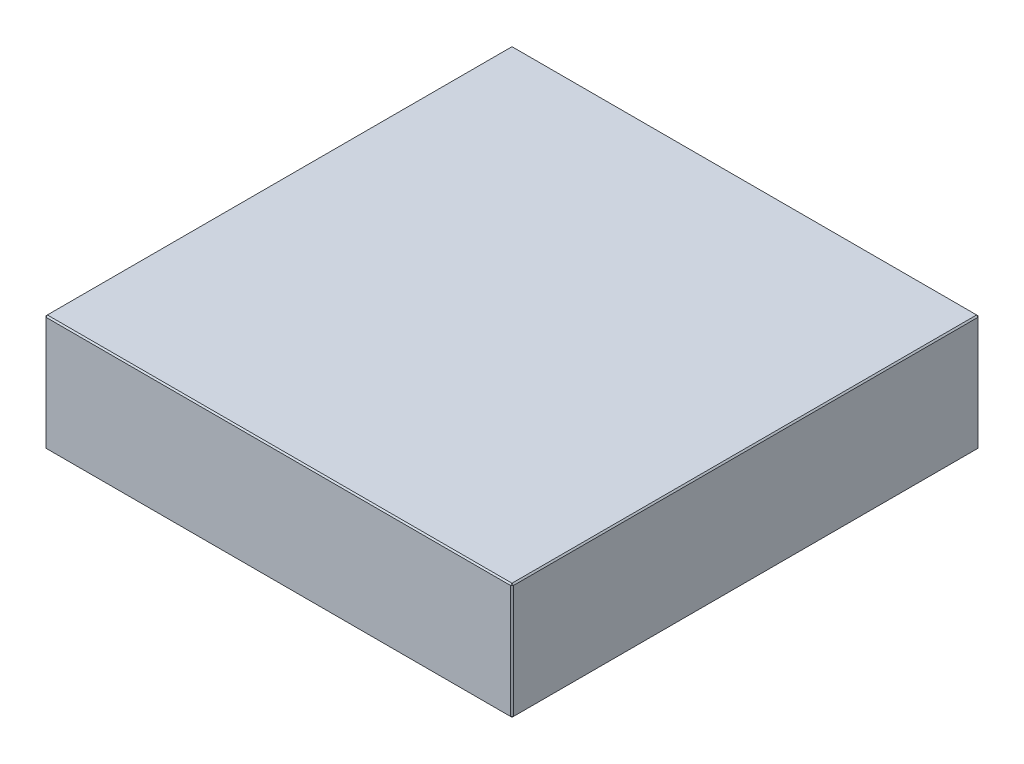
ISO-10303-21;
HEADER;
FILE_DESCRIPTION(('STEP AP214'),'2;1');
FILE_NAME('part.step','',(''),(''),'','','');
FILE_SCHEMA(('AUTOMOTIVE_DESIGN { 1 0 10303 214 1 1 1 1 }'));
ENDSEC;
DATA;
#1=APPLICATION_CONTEXT('core data for automotive mechanical design processes');
#2=APPLICATION_PROTOCOL_DEFINITION('international standard','automotive_design',2000,#1);
#3=PRODUCT_CONTEXT('',#1,'mechanical');
#4=PRODUCT('Part','Part','',(#3));
#5=PRODUCT_RELATED_PRODUCT_CATEGORY('part','',(#4));
#6=PRODUCT_DEFINITION_FORMATION('','',#4);
#7=PRODUCT_DEFINITION_CONTEXT('part definition',#1,'design');
#8=PRODUCT_DEFINITION('design','',#6,#7);
#9=PRODUCT_DEFINITION_SHAPE('','',#8);
#10=(LENGTH_UNIT() NAMED_UNIT(*) SI_UNIT(.MILLI.,.METRE.));
#11=(NAMED_UNIT(*) PLANE_ANGLE_UNIT() SI_UNIT($,.RADIAN.));
#12=(NAMED_UNIT(*) SI_UNIT($,.STERADIAN.) SOLID_ANGLE_UNIT());
#13=UNCERTAINTY_MEASURE_WITH_UNIT(LENGTH_MEASURE(1.E-05),#10,'distance_accuracy_value','');
#14=(GEOMETRIC_REPRESENTATION_CONTEXT(3) GLOBAL_UNCERTAINTY_ASSIGNED_CONTEXT((#13)) GLOBAL_UNIT_ASSIGNED_CONTEXT((#10,
#11,#12)) REPRESENTATION_CONTEXT('',''));
#15=CARTESIAN_POINT('',(0.,0.,0.));
#16=DIRECTION('',(0.,0.,1.));
#17=DIRECTION('',(1.,0.,0.));
#18=AXIS2_PLACEMENT_3D('',#15,#16,#17);
#19=CARTESIAN_POINT('',(-173.,86.,173.));
#20=DIRECTION('',(1.,0.,0.));
#21=DIRECTION('',(0.,0.,-1.));
#22=AXIS2_PLACEMENT_3D('',#19,#20,#21);
#23=PLANE('',#22);
#24=DIRECTION('',(0.,-1.,0.));
#25=VECTOR('',#24,1.);
#26=CARTESIAN_POINT('',(-173.,86.,-172.));
#27=LINE('',#26,#25);
#28=CARTESIAN_POINT('',(-173.,85.,-172.));
#29=VERTEX_POINT('',#28);
#30=CARTESIAN_POINT('',(-173.,1.00000000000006,-172.));
#31=VERTEX_POINT('',#30);
#32=EDGE_CURVE('E114',#29,#31,#27,.T.);
#33=ORIENTED_EDGE('',*,*,#32,.T.);
#34=DIRECTION('',(0.,0.,1.));
#35=VECTOR('',#34,1.);
#36=CARTESIAN_POINT('',(-173.,1.00000000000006,173.));
#37=LINE('',#36,#35);
#38=CARTESIAN_POINT('',(-173.,1.00000000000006,172.));
#39=VERTEX_POINT('',#38);
#40=EDGE_CURVE('E110',#31,#39,#37,.T.);
#41=ORIENTED_EDGE('',*,*,#40,.T.);
#42=DIRECTION('',(0.,1.,0.));
#43=VECTOR('',#42,1.);
#44=CARTESIAN_POINT('',(-173.,86.,172.));
#45=LINE('',#44,#43);
#46=CARTESIAN_POINT('',(-173.,85.,172.));
#47=VERTEX_POINT('',#46);
#48=EDGE_CURVE('E103',#39,#47,#45,.T.);
#49=ORIENTED_EDGE('',*,*,#48,.T.);
#50=DIRECTION('',(0.,0.,-1.));
#51=VECTOR('',#50,1.);
#52=CARTESIAN_POINT('',(-173.,85.,-173.));
#53=LINE('',#52,#51);
#54=EDGE_CURVE('E107',#47,#29,#53,.T.);
#55=ORIENTED_EDGE('',*,*,#54,.T.);
#56=EDGE_LOOP('',(#33,#41,#49,#55));
#57=FACE_BOUND('',#56,.T.);
#58=ADVANCED_FACE('F15',(#57),#23,.F.);
#59=CARTESIAN_POINT('',(173.,86.,173.));
#60=DIRECTION('',(0.,0.,-1.));
#61=DIRECTION('',(-1.,0.,0.));
#62=AXIS2_PLACEMENT_3D('',#59,#60,#61);
#63=PLANE('',#62);
#64=DIRECTION('',(-1.,0.,0.));
#65=VECTOR('',#64,1.);
#66=CARTESIAN_POINT('',(-173.,85.,173.));
#67=LINE('',#66,#65);
#68=CARTESIAN_POINT('',(172.,85.,173.));
#69=VERTEX_POINT('',#68);
#70=CARTESIAN_POINT('',(-172.,85.,173.));
#71=VERTEX_POINT('',#70);
#72=EDGE_CURVE('E164',#69,#71,#67,.T.);
#73=ORIENTED_EDGE('',*,*,#72,.T.);
#74=DIRECTION('',(0.,-1.,0.));
#75=VECTOR('',#74,1.);
#76=CARTESIAN_POINT('',(-172.,86.,173.));
#77=LINE('',#76,#75);
#78=CARTESIAN_POINT('',(-172.,1.00000000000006,173.));
#79=VERTEX_POINT('',#78);
#80=EDGE_CURVE('E122',#71,#79,#77,.T.);
#81=ORIENTED_EDGE('',*,*,#80,.T.);
#82=DIRECTION('',(1.,0.,0.));
#83=VECTOR('',#82,1.);
#84=CARTESIAN_POINT('',(173.,1.00000000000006,173.));
#85=LINE('',#84,#83);
#86=CARTESIAN_POINT('',(172.,1.00000000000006,173.));
#87=VERTEX_POINT('',#86);
#88=EDGE_CURVE('E168',#79,#87,#85,.T.);
#89=ORIENTED_EDGE('',*,*,#88,.T.);
#90=DIRECTION('',(0.,1.,0.));
#91=VECTOR('',#90,1.);
#92=CARTESIAN_POINT('',(172.,86.,173.));
#93=LINE('',#92,#91);
#94=EDGE_CURVE('E166',#87,#69,#93,.T.);
#95=ORIENTED_EDGE('',*,*,#94,.T.);
#96=EDGE_LOOP('',(#73,#81,#89,#95));
#97=FACE_BOUND('',#96,.T.);
#98=ADVANCED_FACE('F275',(#97),#63,.F.);
#99=CARTESIAN_POINT('',(173.,86.,173.));
#100=DIRECTION('',(-1.,0.,0.));
#101=DIRECTION('',(0.,0.,1.));
#102=AXIS2_PLACEMENT_3D('',#99,#100,#101);
#103=PLANE('',#102);
#104=DIRECTION('',(0.,0.,-1.));
#105=VECTOR('',#104,1.);
#106=CARTESIAN_POINT('',(173.,1.00000000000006,173.));
#107=LINE('',#106,#105);
#108=CARTESIAN_POINT('',(173.,1.00000000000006,172.));
#109=VERTEX_POINT('',#108);
#110=CARTESIAN_POINT('',(173.,1.00000000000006,-172.));
#111=VERTEX_POINT('',#110);
#112=EDGE_CURVE('E159',#109,#111,#107,.T.);
#113=ORIENTED_EDGE('',*,*,#112,.T.);
#114=DIRECTION('',(0.,1.,0.));
#115=VECTOR('',#114,1.);
#116=CARTESIAN_POINT('',(173.,86.,-172.));
#117=LINE('',#116,#115);
#118=CARTESIAN_POINT('',(173.,85.,-172.));
#119=VERTEX_POINT('',#118);
#120=EDGE_CURVE('E161',#111,#119,#117,.T.);
#121=ORIENTED_EDGE('',*,*,#120,.T.);
#122=DIRECTION('',(0.,0.,1.));
#123=VECTOR('',#122,1.);
#124=CARTESIAN_POINT('',(173.,85.,173.));
#125=LINE('',#124,#123);
#126=CARTESIAN_POINT('',(173.,85.,172.));
#127=VERTEX_POINT('',#126);
#128=EDGE_CURVE('E155',#119,#127,#125,.T.);
#129=ORIENTED_EDGE('',*,*,#128,.T.);
#130=DIRECTION('',(0.,-1.,0.));
#131=VECTOR('',#130,1.);
#132=CARTESIAN_POINT('',(173.,86.,172.));
#133=LINE('',#132,#131);
#134=EDGE_CURVE('E157',#127,#109,#133,.T.);
#135=ORIENTED_EDGE('',*,*,#134,.T.);
#136=EDGE_LOOP('',(#113,#121,#129,#135));
#137=FACE_BOUND('',#136,.T.);
#138=ADVANCED_FACE('F254',(#137),#103,.F.);
#139=CARTESIAN_POINT('',(173.,86.,-173.));
#140=DIRECTION('',(0.,0.,1.));
#141=DIRECTION('',(1.,0.,0.));
#142=AXIS2_PLACEMENT_3D('',#139,#140,#141);
#143=PLANE('',#142);
#144=DIRECTION('',(0.,-1.,0.));
#145=VECTOR('',#144,1.);
#146=CARTESIAN_POINT('',(172.,86.,-173.));
#147=LINE('',#146,#145);
#148=CARTESIAN_POINT('',(172.,85.,-173.));
#149=VERTEX_POINT('',#148);
#150=CARTESIAN_POINT('',(172.,1.00000000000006,-173.));
#151=VERTEX_POINT('',#150);
#152=EDGE_CURVE('E148',#149,#151,#147,.T.);
#153=ORIENTED_EDGE('',*,*,#152,.T.);
#154=DIRECTION('',(-1.,0.,0.));
#155=VECTOR('',#154,1.);
#156=CARTESIAN_POINT('',(173.,1.00000000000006,-173.));
#157=LINE('',#156,#155);
#158=CARTESIAN_POINT('',(-172.,1.00000000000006,-173.));
#159=VERTEX_POINT('',#158);
#160=EDGE_CURVE('E153',#151,#159,#157,.T.);
#161=ORIENTED_EDGE('',*,*,#160,.T.);
#162=DIRECTION('',(0.,1.,0.));
#163=VECTOR('',#162,1.);
#164=CARTESIAN_POINT('',(-172.,86.,-173.));
#165=LINE('',#164,#163);
#166=CARTESIAN_POINT('',(-172.,85.,-173.));
#167=VERTEX_POINT('',#166);
#168=EDGE_CURVE('E150',#159,#167,#165,.T.);
#169=ORIENTED_EDGE('',*,*,#168,.T.);
#170=DIRECTION('',(1.,0.,0.));
#171=VECTOR('',#170,1.);
#172=CARTESIAN_POINT('',(173.,85.,-173.));
#173=LINE('',#172,#171);
#174=EDGE_CURVE('E146',#167,#149,#173,.T.);
#175=ORIENTED_EDGE('',*,*,#174,.T.);
#176=EDGE_LOOP('',(#153,#161,#169,#175));
#177=FACE_BOUND('',#176,.T.);
#178=ADVANCED_FACE('F284',(#177),#143,.F.);
#179=CARTESIAN_POINT('',(0.,86.,0.));
#180=DIRECTION('',(0.,1.,0.));
#181=DIRECTION('',(0.,0.,1.));
#182=AXIS2_PLACEMENT_3D('',#179,#180,#181);
#183=PLANE('',#182);
#184=DIRECTION('',(0.,0.,-1.));
#185=VECTOR('',#184,1.);
#186=CARTESIAN_POINT('',(172.,86.,-173.));
#187=LINE('',#186,#185);
#188=CARTESIAN_POINT('',(172.,86.,172.));
#189=VERTEX_POINT('',#188);
#190=CARTESIAN_POINT('',(172.,86.,-172.));
#191=VERTEX_POINT('',#190);
#192=EDGE_CURVE('E24',#189,#191,#187,.T.);
#193=ORIENTED_EDGE('',*,*,#192,.T.);
#194=DIRECTION('',(-1.,0.,0.));
#195=VECTOR('',#194,1.);
#196=CARTESIAN_POINT('',(-173.,86.,-172.));
#197=LINE('',#196,#195);
#198=CARTESIAN_POINT('',(-172.,86.,-172.));
#199=VERTEX_POINT('',#198);
#200=EDGE_CURVE('E9',#191,#199,#197,.T.);
#201=ORIENTED_EDGE('',*,*,#200,.T.);
#202=DIRECTION('',(0.,0.,1.));
#203=VECTOR('',#202,1.);
#204=CARTESIAN_POINT('',(-172.,86.,173.));
#205=LINE('',#204,#203);
#206=CARTESIAN_POINT('',(-172.,86.,172.));
#207=VERTEX_POINT('',#206);
#208=EDGE_CURVE('E180',#199,#207,#205,.T.);
#209=ORIENTED_EDGE('',*,*,#208,.T.);
#210=DIRECTION('',(1.,0.,0.));
#211=VECTOR('',#210,1.);
#212=CARTESIAN_POINT('',(173.,86.,172.));
#213=LINE('',#212,#211);
#214=EDGE_CURVE('E35',#207,#189,#213,.T.);
#215=ORIENTED_EDGE('',*,*,#214,.T.);
#216=EDGE_LOOP('',(#193,#201,#209,#215));
#217=FACE_BOUND('',#216,.T.);
#218=ADVANCED_FACE('F350',(#217),#183,.T.);
#219=CARTESIAN_POINT('',(0.,0.,0.));
#220=DIRECTION('',(0.,1.,0.));
#221=DIRECTION('',(0.,0.,1.));
#222=AXIS2_PLACEMENT_3D('',#219,#220,#221);
#223=PLANE('',#222);
#224=DIRECTION('',(0.,0.,1.));
#225=VECTOR('',#224,1.);
#226=CARTESIAN_POINT('',(172.,0.,0.));
#227=LINE('',#226,#225);
#228=CARTESIAN_POINT('',(172.,0.,-172.));
#229=VERTEX_POINT('',#228);
#230=CARTESIAN_POINT('',(172.,0.,172.));
#231=VERTEX_POINT('',#230);
#232=EDGE_CURVE('E171',#229,#231,#227,.T.);
#233=ORIENTED_EDGE('',*,*,#232,.T.);
#234=DIRECTION('',(-1.,0.,0.));
#235=VECTOR('',#234,1.);
#236=CARTESIAN_POINT('',(0.,0.,172.));
#237=LINE('',#236,#235);
#238=CARTESIAN_POINT('',(-172.,0.,172.));
#239=VERTEX_POINT('',#238);
#240=EDGE_CURVE('E177',#231,#239,#237,.T.);
#241=ORIENTED_EDGE('',*,*,#240,.T.);
#242=DIRECTION('',(0.,0.,-1.));
#243=VECTOR('',#242,1.);
#244=CARTESIAN_POINT('',(-172.,0.,0.));
#245=LINE('',#244,#243);
#246=CARTESIAN_POINT('',(-172.,0.,-172.));
#247=VERTEX_POINT('',#246);
#248=EDGE_CURVE('E175',#239,#247,#245,.T.);
#249=ORIENTED_EDGE('',*,*,#248,.T.);
#250=DIRECTION('',(1.,0.,0.));
#251=VECTOR('',#250,1.);
#252=CARTESIAN_POINT('',(0.,0.,-172.));
#253=LINE('',#252,#251);
#254=EDGE_CURVE('E173',#247,#229,#253,.T.);
#255=ORIENTED_EDGE('',*,*,#254,.T.);
#256=EDGE_LOOP('',(#233,#241,#249,#255));
#257=FACE_BOUND('',#256,.T.);
#258=ADVANCED_FACE('F246',(#257),#223,.F.);
#259=CARTESIAN_POINT('',(173.,86.,172.));
#260=DIRECTION('',(-0.707106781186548,0.,-0.707106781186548));
#261=DIRECTION('',(0.,-1.,0.));
#262=AXIS2_PLACEMENT_3D('',#259,#260,#261);
#263=PLANE('',#262);
#264=DIRECTION('',(-0.707106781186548,0.,0.707106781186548));
#265=VECTOR('',#264,1.);
#266=CARTESIAN_POINT('',(172.,85.,173.));
#267=LINE('',#266,#265);
#268=EDGE_CURVE('E19',#69,#127,#267,.F.);
#269=ORIENTED_EDGE('',*,*,#268,.F.);
#270=ORIENTED_EDGE('',*,*,#94,.F.);
#271=DIRECTION('',(0.707106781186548,0.,-0.707106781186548));
#272=VECTOR('',#271,1.);
#273=CARTESIAN_POINT('',(172.,1.00000000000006,173.));
#274=LINE('',#273,#272);
#275=EDGE_CURVE('E142',#109,#87,#274,.F.);
#276=ORIENTED_EDGE('',*,*,#275,.F.);
#277=ORIENTED_EDGE('',*,*,#134,.F.);
#278=EDGE_LOOP('',(#269,#270,#276,#277));
#279=FACE_BOUND('',#278,.T.);
#280=ADVANCED_FACE('F17',(#279),#263,.F.);
#281=CARTESIAN_POINT('',(172.,85.,173.));
#282=DIRECTION('',(0.577350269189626,0.577350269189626,0.577350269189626));
#283=DIRECTION('',(0.707106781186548,0.,-0.707106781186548));
#284=AXIS2_PLACEMENT_3D('',#281,#282,#283);
#285=PLANE('',#284);
#286=DIRECTION('',(0.,-0.707106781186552,0.707106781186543));
#287=VECTOR('',#286,1.);
#288=CARTESIAN_POINT('',(172.,85.,173.));
#289=LINE('',#288,#287);
#290=EDGE_CURVE('E226',#69,#189,#289,.F.);
#291=ORIENTED_EDGE('',*,*,#290,.F.);
#292=ORIENTED_EDGE('',*,*,#268,.T.);
#293=DIRECTION('',(-0.707106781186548,0.707106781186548,0.));
#294=VECTOR('',#293,1.);
#295=CARTESIAN_POINT('',(172.5,85.5,172.));
#296=LINE('',#295,#294);
#297=EDGE_CURVE('E228',#189,#127,#296,.F.);
#298=ORIENTED_EDGE('',*,*,#297,.F.);
#299=EDGE_LOOP('',(#291,#292,#298));
#300=FACE_BOUND('',#299,.T.);
#301=ADVANCED_FACE('F270',(#300),#285,.T.);
#302=CARTESIAN_POINT('',(172.,1.00000000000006,173.));
#303=DIRECTION('',(0.577350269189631,-0.577350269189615,0.577350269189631));
#304=DIRECTION('',(0.707106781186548,0.,-0.707106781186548));
#305=AXIS2_PLACEMENT_3D('',#302,#303,#304);
#306=PLANE('',#305);
#307=DIRECTION('',(-0.707106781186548,-0.707106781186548,0.));
#308=VECTOR('',#307,1.);
#309=CARTESIAN_POINT('',(172.5,0.500000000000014,172.));
#310=LINE('',#309,#308);
#311=EDGE_CURVE('E220',#109,#231,#310,.T.);
#312=ORIENTED_EDGE('',*,*,#311,.F.);
#313=ORIENTED_EDGE('',*,*,#275,.T.);
#314=DIRECTION('',(0.,0.707106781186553,0.707106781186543));
#315=VECTOR('',#314,1.);
#316=CARTESIAN_POINT('',(172.,1.00000000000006,173.));
#317=LINE('',#316,#315);
#318=EDGE_CURVE('E223',#231,#87,#317,.T.);
#319=ORIENTED_EDGE('',*,*,#318,.F.);
#320=EDGE_LOOP('',(#312,#313,#319));
#321=FACE_BOUND('',#320,.T.);
#322=ADVANCED_FACE('F235',(#321),#306,.T.);
#323=CARTESIAN_POINT('',(172.,86.,0.));
#324=DIRECTION('',(0.707106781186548,0.707106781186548,0.));
#325=DIRECTION('',(0.,0.,1.));
#326=AXIS2_PLACEMENT_3D('',#323,#324,#325);
#327=PLANE('',#326);
#328=ORIENTED_EDGE('',*,*,#297,.T.);
#329=ORIENTED_EDGE('',*,*,#128,.F.);
#330=DIRECTION('',(0.707106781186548,-0.707106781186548,0.));
#331=VECTOR('',#330,1.);
#332=CARTESIAN_POINT('',(173.,85.,-172.));
#333=LINE('',#332,#331);
#334=EDGE_CURVE('E215',#191,#119,#333,.T.);
#335=ORIENTED_EDGE('',*,*,#334,.F.);
#336=ORIENTED_EDGE('',*,*,#192,.F.);
#337=EDGE_LOOP('',(#328,#329,#335,#336));
#338=FACE_BOUND('',#337,.T.);
#339=ADVANCED_FACE('F265',(#338),#327,.T.);
#340=CARTESIAN_POINT('',(0.,86.,172.));
#341=DIRECTION('',(0.,0.707106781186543,0.707106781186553));
#342=DIRECTION('',(-1.,0.,0.));
#343=AXIS2_PLACEMENT_3D('',#340,#341,#342);
#344=PLANE('',#343);
#345=ORIENTED_EDGE('',*,*,#290,.T.);
#346=ORIENTED_EDGE('',*,*,#214,.F.);
#347=DIRECTION('',(0.,0.707106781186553,-0.707106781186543));
#348=VECTOR('',#347,1.);
#349=CARTESIAN_POINT('',(-172.,85.5,172.5));
#350=LINE('',#349,#348);
#351=EDGE_CURVE('E126',#71,#207,#350,.T.);
#352=ORIENTED_EDGE('',*,*,#351,.F.);
#353=ORIENTED_EDGE('',*,*,#72,.F.);
#354=EDGE_LOOP('',(#345,#346,#352,#353));
#355=FACE_BOUND('',#354,.T.);
#356=ADVANCED_FACE('F273',(#355),#344,.T.);
#357=CARTESIAN_POINT('',(-172.,86.,173.));
#358=DIRECTION('',(0.707106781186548,0.,-0.707106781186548));
#359=DIRECTION('',(0.,-1.,0.));
#360=AXIS2_PLACEMENT_3D('',#357,#358,#359);
#361=PLANE('',#360);
#362=DIRECTION('',(0.707106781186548,0.,0.707106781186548));
#363=VECTOR('',#362,1.);
#364=CARTESIAN_POINT('',(-172.,1.00000000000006,173.));
#365=LINE('',#364,#363);
#366=EDGE_CURVE('E127',#79,#39,#365,.F.);
#367=ORIENTED_EDGE('',*,*,#366,.F.);
#368=ORIENTED_EDGE('',*,*,#80,.F.);
#369=DIRECTION('',(-0.707106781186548,0.,-0.707106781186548));
#370=VECTOR('',#369,1.);
#371=CARTESIAN_POINT('',(-173.,85.,172.));
#372=LINE('',#371,#370);
#373=EDGE_CURVE('E118',#47,#71,#372,.F.);
#374=ORIENTED_EDGE('',*,*,#373,.F.);
#375=ORIENTED_EDGE('',*,*,#48,.F.);
#376=EDGE_LOOP('',(#367,#368,#374,#375));
#377=FACE_BOUND('',#376,.T.);
#378=ADVANCED_FACE('F120',(#377),#361,.F.);
#379=CARTESIAN_POINT('',(173.,1.00000000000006,173.));
#380=DIRECTION('',(0.,0.707106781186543,-0.707106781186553));
#381=DIRECTION('',(1.,0.,0.));
#382=AXIS2_PLACEMENT_3D('',#379,#380,#381);
#383=PLANE('',#382);
#384=ORIENTED_EDGE('',*,*,#318,.T.);
#385=ORIENTED_EDGE('',*,*,#88,.F.);
#386=DIRECTION('',(0.,-0.707106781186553,-0.707106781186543));
#387=VECTOR('',#386,1.);
#388=CARTESIAN_POINT('',(-172.,1.00000000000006,173.));
#389=LINE('',#388,#387);
#390=EDGE_CURVE('E211',#239,#79,#389,.F.);
#391=ORIENTED_EDGE('',*,*,#390,.F.);
#392=ORIENTED_EDGE('',*,*,#240,.F.);
#393=EDGE_LOOP('',(#384,#385,#391,#392));
#394=FACE_BOUND('',#393,.T.);
#395=ADVANCED_FACE('F243',(#394),#383,.F.);
#396=CARTESIAN_POINT('',(173.,1.00000000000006,173.));
#397=DIRECTION('',(-0.707106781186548,0.707106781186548,0.));
#398=DIRECTION('',(0.,0.,-1.));
#399=AXIS2_PLACEMENT_3D('',#396,#397,#398);
#400=PLANE('',#399);
#401=ORIENTED_EDGE('',*,*,#311,.T.);
#402=ORIENTED_EDGE('',*,*,#232,.F.);
#403=DIRECTION('',(0.707106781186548,0.707106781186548,0.));
#404=VECTOR('',#403,1.);
#405=CARTESIAN_POINT('',(172.5,0.500000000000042,-172.));
#406=LINE('',#405,#404);
#407=EDGE_CURVE('E208',#111,#229,#406,.F.);
#408=ORIENTED_EDGE('',*,*,#407,.F.);
#409=ORIENTED_EDGE('',*,*,#112,.F.);
#410=EDGE_LOOP('',(#401,#402,#408,#409));
#411=FACE_BOUND('',#410,.T.);
#412=ADVANCED_FACE('F251',(#411),#400,.F.);
#413=CARTESIAN_POINT('',(172.,86.,-173.));
#414=DIRECTION('',(-0.707106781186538,0.,0.707106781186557));
#415=DIRECTION('',(0.,-1.,0.));
#416=AXIS2_PLACEMENT_3D('',#413,#414,#415);
#417=PLANE('',#416);
#418=DIRECTION('',(0.707106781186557,0.,0.707106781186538));
#419=VECTOR('',#418,1.);
#420=CARTESIAN_POINT('',(173.,85.,-172.));
#421=LINE('',#420,#419);
#422=EDGE_CURVE('E217',#119,#149,#421,.F.);
#423=ORIENTED_EDGE('',*,*,#422,.F.);
#424=ORIENTED_EDGE('',*,*,#120,.F.);
#425=DIRECTION('',(-0.707106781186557,0.,-0.707106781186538));
#426=VECTOR('',#425,1.);
#427=CARTESIAN_POINT('',(172.,1.00000000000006,-173.));
#428=LINE('',#427,#426);
#429=EDGE_CURVE('E205',#151,#111,#428,.F.);
#430=ORIENTED_EDGE('',*,*,#429,.F.);
#431=ORIENTED_EDGE('',*,*,#152,.F.);
#432=EDGE_LOOP('',(#423,#424,#430,#431));
#433=FACE_BOUND('',#432,.T.);
#434=ADVANCED_FACE('F258',(#433),#417,.F.);
#435=CARTESIAN_POINT('',(173.,85.,-172.));
#436=DIRECTION('',(0.577350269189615,0.577350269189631,-0.577350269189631));
#437=DIRECTION('',(0.,0.707106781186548,0.707106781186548));
#438=AXIS2_PLACEMENT_3D('',#435,#436,#437);
#439=PLANE('',#438);
#440=ORIENTED_EDGE('',*,*,#334,.T.);
#441=ORIENTED_EDGE('',*,*,#422,.T.);
#442=DIRECTION('',(0.,0.707106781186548,0.707106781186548));
#443=VECTOR('',#442,1.);
#444=CARTESIAN_POINT('',(172.,85.5,-172.5));
#445=LINE('',#444,#443);
#446=EDGE_CURVE('E134',#191,#149,#445,.F.);
#447=ORIENTED_EDGE('',*,*,#446,.F.);
#448=EDGE_LOOP('',(#440,#441,#447));
#449=FACE_BOUND('',#448,.T.);
#450=ADVANCED_FACE('F325',(#449),#439,.T.);
#451=CARTESIAN_POINT('',(-173.,85.,172.));
#452=DIRECTION('',(-0.577350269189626,0.577350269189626,0.577350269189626));
#453=DIRECTION('',(0.707106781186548,0.,0.707106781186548));
#454=AXIS2_PLACEMENT_3D('',#451,#452,#453);
#455=PLANE('',#454);
#456=ORIENTED_EDGE('',*,*,#373,.T.);
#457=ORIENTED_EDGE('',*,*,#351,.T.);
#458=DIRECTION('',(-0.707106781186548,-0.707106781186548,0.));
#459=VECTOR('',#458,1.);
#460=CARTESIAN_POINT('',(-173.,85.,172.));
#461=LINE('',#460,#459);
#462=EDGE_CURVE('E130',#47,#207,#461,.F.);
#463=ORIENTED_EDGE('',*,*,#462,.F.);
#464=EDGE_LOOP('',(#456,#457,#463));
#465=FACE_BOUND('',#464,.T.);
#466=ADVANCED_FACE('F131',(#465),#455,.T.);
#467=CARTESIAN_POINT('',(-172.,1.00000000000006,173.));
#468=DIRECTION('',(-0.577350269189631,-0.577350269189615,0.577350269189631));
#469=DIRECTION('',(0.707106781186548,0.,0.707106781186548));
#470=AXIS2_PLACEMENT_3D('',#467,#468,#469);
#471=PLANE('',#470);
#472=ORIENTED_EDGE('',*,*,#390,.T.);
#473=ORIENTED_EDGE('',*,*,#366,.T.);
#474=DIRECTION('',(-0.707106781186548,0.707106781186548,0.));
#475=VECTOR('',#474,1.);
#476=CARTESIAN_POINT('',(-172.5,0.500000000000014,172.));
#477=LINE('',#476,#475);
#478=EDGE_CURVE('E135',#239,#39,#477,.T.);
#479=ORIENTED_EDGE('',*,*,#478,.F.);
#480=EDGE_LOOP('',(#472,#473,#479));
#481=FACE_BOUND('',#480,.T.);
#482=ADVANCED_FACE('F318',(#481),#471,.T.);
#483=CARTESIAN_POINT('',(172.,1.00000000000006,-173.));
#484=DIRECTION('',(0.577350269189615,-0.577350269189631,-0.577350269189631));
#485=DIRECTION('',(0.,0.707106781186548,-0.707106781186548));
#486=AXIS2_PLACEMENT_3D('',#483,#484,#485);
#487=PLANE('',#486);
#488=ORIENTED_EDGE('',*,*,#429,.T.);
#489=ORIENTED_EDGE('',*,*,#407,.T.);
#490=DIRECTION('',(0.,-0.707106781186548,0.707106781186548));
#491=VECTOR('',#490,1.);
#492=CARTESIAN_POINT('',(172.,1.00000000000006,-173.));
#493=LINE('',#492,#491);
#494=EDGE_CURVE('E198',#151,#229,#493,.T.);
#495=ORIENTED_EDGE('',*,*,#494,.F.);
#496=EDGE_LOOP('',(#488,#489,#495));
#497=FACE_BOUND('',#496,.T.);
#498=ADVANCED_FACE('F314',(#497),#487,.T.);
#499=CARTESIAN_POINT('',(0.,86.,-172.));
#500=DIRECTION('',(0.,0.707106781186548,-0.707106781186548));
#501=DIRECTION('',(1.,0.,0.));
#502=AXIS2_PLACEMENT_3D('',#499,#500,#501);
#503=PLANE('',#502);
#504=ORIENTED_EDGE('',*,*,#446,.T.);
#505=ORIENTED_EDGE('',*,*,#174,.F.);
#506=DIRECTION('',(0.,-0.707106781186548,-0.707106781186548));
#507=VECTOR('',#506,1.);
#508=CARTESIAN_POINT('',(-172.,85.,-173.));
#509=LINE('',#508,#507);
#510=EDGE_CURVE('E195',#199,#167,#509,.T.);
#511=ORIENTED_EDGE('',*,*,#510,.F.);
#512=ORIENTED_EDGE('',*,*,#200,.F.);
#513=EDGE_LOOP('',(#504,#505,#511,#512));
#514=FACE_BOUND('',#513,.T.);
#515=ADVANCED_FACE('F311',(#514),#503,.T.);
#516=CARTESIAN_POINT('',(-172.,86.,0.));
#517=DIRECTION('',(-0.707106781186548,0.707106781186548,0.));
#518=DIRECTION('',(0.,0.,-1.));
#519=AXIS2_PLACEMENT_3D('',#516,#517,#518);
#520=PLANE('',#519);
#521=ORIENTED_EDGE('',*,*,#462,.T.);
#522=ORIENTED_EDGE('',*,*,#208,.F.);
#523=DIRECTION('',(0.707106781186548,0.707106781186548,0.));
#524=VECTOR('',#523,1.);
#525=CARTESIAN_POINT('',(-172.5,85.5,-172.));
#526=LINE('',#525,#524);
#527=EDGE_CURVE('E138',#29,#199,#526,.T.);
#528=ORIENTED_EDGE('',*,*,#527,.F.);
#529=ORIENTED_EDGE('',*,*,#54,.F.);
#530=EDGE_LOOP('',(#521,#522,#528,#529));
#531=FACE_BOUND('',#530,.T.);
#532=ADVANCED_FACE('F137',(#531),#520,.T.);
#533=CARTESIAN_POINT('',(-173.,1.00000000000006,173.));
#534=DIRECTION('',(0.707106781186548,0.707106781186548,0.));
#535=DIRECTION('',(0.,0.,1.));
#536=AXIS2_PLACEMENT_3D('',#533,#534,#535);
#537=PLANE('',#536);
#538=ORIENTED_EDGE('',*,*,#478,.T.);
#539=ORIENTED_EDGE('',*,*,#40,.F.);
#540=DIRECTION('',(0.707106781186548,-0.707106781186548,0.));
#541=VECTOR('',#540,1.);
#542=CARTESIAN_POINT('',(-173.,1.00000000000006,-172.));
#543=LINE('',#542,#541);
#544=EDGE_CURVE('E191',#247,#31,#543,.F.);
#545=ORIENTED_EDGE('',*,*,#544,.F.);
#546=ORIENTED_EDGE('',*,*,#248,.F.);
#547=EDGE_LOOP('',(#538,#539,#545,#546));
#548=FACE_BOUND('',#547,.T.);
#549=ADVANCED_FACE('F304',(#548),#537,.F.);
#550=CARTESIAN_POINT('',(173.,1.00000000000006,-173.));
#551=DIRECTION('',(0.,0.707106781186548,0.707106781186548));
#552=DIRECTION('',(-1.,0.,0.));
#553=AXIS2_PLACEMENT_3D('',#550,#551,#552);
#554=PLANE('',#553);
#555=ORIENTED_EDGE('',*,*,#494,.T.);
#556=ORIENTED_EDGE('',*,*,#254,.F.);
#557=DIRECTION('',(0.,0.707106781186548,-0.707106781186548));
#558=VECTOR('',#557,1.);
#559=CARTESIAN_POINT('',(-172.,0.500000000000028,-172.5));
#560=LINE('',#559,#558);
#561=EDGE_CURVE('E188',#159,#247,#560,.F.);
#562=ORIENTED_EDGE('',*,*,#561,.F.);
#563=ORIENTED_EDGE('',*,*,#160,.F.);
#564=EDGE_LOOP('',(#555,#556,#562,#563));
#565=FACE_BOUND('',#564,.T.);
#566=ADVANCED_FACE('F300',(#565),#554,.F.);
#567=CARTESIAN_POINT('',(-172.,85.,-173.));
#568=DIRECTION('',(-0.577350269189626,0.577350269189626,-0.577350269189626));
#569=DIRECTION('',(-0.707106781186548,0.,0.707106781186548));
#570=AXIS2_PLACEMENT_3D('',#567,#568,#569);
#571=PLANE('',#570);
#572=ORIENTED_EDGE('',*,*,#527,.T.);
#573=ORIENTED_EDGE('',*,*,#510,.T.);
#574=DIRECTION('',(0.707106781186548,0.,-0.707106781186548));
#575=VECTOR('',#574,1.);
#576=CARTESIAN_POINT('',(-172.,85.,-173.));
#577=LINE('',#576,#575);
#578=EDGE_CURVE('E186',#29,#167,#577,.T.);
#579=ORIENTED_EDGE('',*,*,#578,.F.);
#580=EDGE_LOOP('',(#572,#573,#579));
#581=FACE_BOUND('',#580,.T.);
#582=ADVANCED_FACE('F296',(#581),#571,.T.);
#583=CARTESIAN_POINT('',(-173.,1.00000000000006,-172.));
#584=DIRECTION('',(-0.577350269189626,-0.577350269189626,-0.577350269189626));
#585=DIRECTION('',(-0.707106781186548,0.,0.707106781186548));
#586=AXIS2_PLACEMENT_3D('',#583,#584,#585);
#587=PLANE('',#586);
#588=ORIENTED_EDGE('',*,*,#561,.T.);
#589=ORIENTED_EDGE('',*,*,#544,.T.);
#590=DIRECTION('',(-0.707106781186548,0.,0.707106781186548));
#591=VECTOR('',#590,1.);
#592=CARTESIAN_POINT('',(-173.,1.00000000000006,-172.));
#593=LINE('',#592,#591);
#594=EDGE_CURVE('E184',#159,#31,#593,.T.);
#595=ORIENTED_EDGE('',*,*,#594,.F.);
#596=EDGE_LOOP('',(#588,#589,#595));
#597=FACE_BOUND('',#596,.T.);
#598=ADVANCED_FACE('F292',(#597),#587,.T.);
#599=CARTESIAN_POINT('',(-173.,86.,-172.));
#600=DIRECTION('',(0.707106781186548,0.,0.707106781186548));
#601=DIRECTION('',(0.,-1.,0.));
#602=AXIS2_PLACEMENT_3D('',#599,#600,#601);
#603=PLANE('',#602);
#604=ORIENTED_EDGE('',*,*,#578,.T.);
#605=ORIENTED_EDGE('',*,*,#168,.F.);
#606=ORIENTED_EDGE('',*,*,#594,.T.);
#607=ORIENTED_EDGE('',*,*,#32,.F.);
#608=EDGE_LOOP('',(#604,#605,#606,#607));
#609=FACE_BOUND('',#608,.T.);
#610=ADVANCED_FACE('F289',(#609),#603,.F.);
#611=CLOSED_SHELL('',(#58,#98,#138,#178,#218,#258,#280,#301,#322,#339,#356,#378,#395,#412,#434,
#450,#466,#482,#498,#515,#532,#549,#566,#582,#598,#610));
#612=MANIFOLD_SOLID_BREP('B1',#611);
#613=ADVANCED_BREP_SHAPE_REPRESENTATION('',(#18,#612),#14);
#614=SHAPE_DEFINITION_REPRESENTATION(#9,#613);
ENDSEC;
END-ISO-10303-21;
